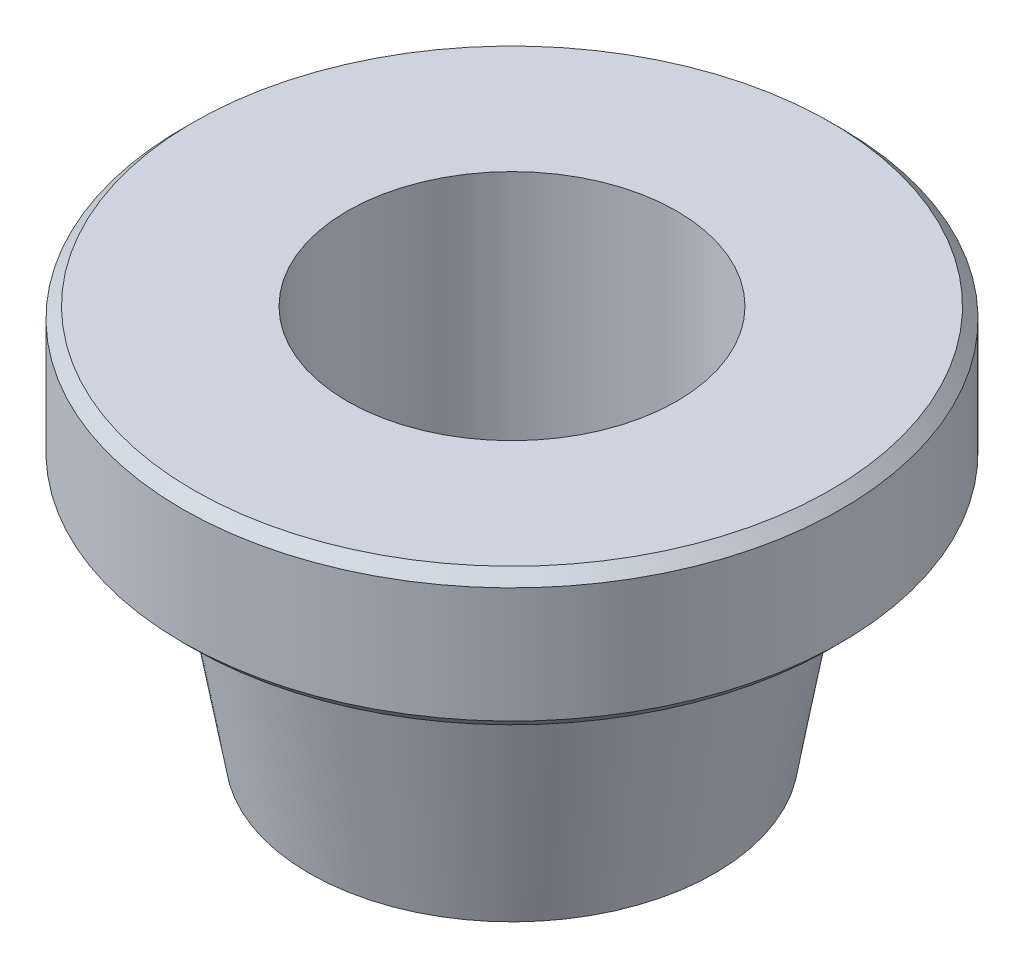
ISO-10303-21;
HEADER;
FILE_DESCRIPTION(('STEP AP214'),'2;1');
FILE_NAME('part.step','',(''),(''),'','','');
FILE_SCHEMA(('AUTOMOTIVE_DESIGN { 1 0 10303 214 1 1 1 1 }'));
ENDSEC;
DATA;
#1=APPLICATION_CONTEXT('core data for automotive mechanical design processes');
#2=APPLICATION_PROTOCOL_DEFINITION('international standard','automotive_design',2000,#1);
#3=PRODUCT_CONTEXT('',#1,'mechanical');
#4=PRODUCT('Part','Part','',(#3));
#5=PRODUCT_RELATED_PRODUCT_CATEGORY('part','',(#4));
#6=PRODUCT_DEFINITION_FORMATION('','',#4);
#7=PRODUCT_DEFINITION_CONTEXT('part definition',#1,'design');
#8=PRODUCT_DEFINITION('design','',#6,#7);
#9=PRODUCT_DEFINITION_SHAPE('','',#8);
#10=(LENGTH_UNIT() NAMED_UNIT(*) SI_UNIT(.MILLI.,.METRE.));
#11=(NAMED_UNIT(*) PLANE_ANGLE_UNIT() SI_UNIT($,.RADIAN.));
#12=(NAMED_UNIT(*) SI_UNIT($,.STERADIAN.) SOLID_ANGLE_UNIT());
#13=UNCERTAINTY_MEASURE_WITH_UNIT(LENGTH_MEASURE(1.E-05),#10,'distance_accuracy_value','');
#14=(GEOMETRIC_REPRESENTATION_CONTEXT(3) GLOBAL_UNCERTAINTY_ASSIGNED_CONTEXT((#13)) GLOBAL_UNIT_ASSIGNED_CONTEXT((#10,
#11,#12)) REPRESENTATION_CONTEXT('',''));
#15=CARTESIAN_POINT('',(0.,0.,0.));
#16=DIRECTION('',(0.,0.,1.));
#17=DIRECTION('',(1.,0.,0.));
#18=AXIS2_PLACEMENT_3D('',#15,#16,#17);
#19=CARTESIAN_POINT('',(0.,0.,0.));
#20=DIRECTION('',(0.,1.,0.));
#21=DIRECTION('',(0.,0.,1.));
#22=AXIS2_PLACEMENT_3D('',#19,#20,#21);
#23=CYLINDRICAL_SURFACE('',#22,3.);
#24=CARTESIAN_POINT('',(0.,-3.1,0.));
#25=DIRECTION('',(0.,1.,0.));
#26=DIRECTION('',(0.,0.,1.));
#27=AXIS2_PLACEMENT_3D('',#24,#25,#26);
#28=CIRCLE('',#27,3.);
#29=CARTESIAN_POINT('',(0.,-3.1,3.));
#30=VERTEX_POINT('',#29);
#31=EDGE_CURVE('E66',#30,#30,#28,.T.);
#32=ORIENTED_EDGE('',*,*,#31,.F.);
#33=EDGE_LOOP('',(#32));
#34=FACE_BOUND('',#33,.T.);
#35=CARTESIAN_POINT('',(0.,2.5,0.));
#36=DIRECTION('',(0.,1.,0.));
#37=DIRECTION('',(0.,0.,1.));
#38=AXIS2_PLACEMENT_3D('',#35,#36,#37);
#39=CIRCLE('',#38,3.);
#40=CARTESIAN_POINT('',(0.,2.5,3.));
#41=VERTEX_POINT('',#40);
#42=EDGE_CURVE('E57',#41,#41,#39,.T.);
#43=ORIENTED_EDGE('',*,*,#42,.T.);
#44=EDGE_LOOP('',(#43));
#45=FACE_BOUND('',#44,.T.);
#46=ADVANCED_FACE('F31',(#34,#45),#23,.F.);
#47=CARTESIAN_POINT('',(0.,0.,0.));
#48=DIRECTION('',(0.,1.,0.));
#49=DIRECTION('',(0.,0.,1.));
#50=AXIS2_PLACEMENT_3D('',#47,#48,#49);
#51=CONICAL_SURFACE('',#50,4.5,0.174532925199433);
#52=CARTESIAN_POINT('',(0.,-4.6,0.));
#53=DIRECTION('',(0.,1.,0.));
#54=DIRECTION('',(0.,0.,1.));
#55=AXIS2_PLACEMENT_3D('',#52,#53,#54);
#56=CIRCLE('',#55,3.68889588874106);
#57=CARTESIAN_POINT('',(0.,-4.6,3.68889588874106));
#58=VERTEX_POINT('',#57);
#59=EDGE_CURVE('E51',#58,#58,#56,.T.);
#60=ORIENTED_EDGE('',*,*,#59,.T.);
#61=EDGE_LOOP('',(#60));
#62=FACE_BOUND('',#61,.T.);
#63=CARTESIAN_POINT('',(0.,0.,0.));
#64=DIRECTION('',(0.,1.,0.));
#65=DIRECTION('',(0.,0.,1.));
#66=AXIS2_PLACEMENT_3D('',#63,#64,#65);
#67=CIRCLE('',#66,4.5);
#68=CARTESIAN_POINT('',(0.,0.,4.5));
#69=VERTEX_POINT('',#68);
#70=EDGE_CURVE('E54',#69,#69,#67,.T.);
#71=ORIENTED_EDGE('',*,*,#70,.F.);
#72=EDGE_LOOP('',(#71));
#73=FACE_BOUND('',#72,.T.);
#74=ADVANCED_FACE('F93',(#62,#73),#51,.T.);
#75=CARTESIAN_POINT('',(0.,-4.6,0.));
#76=DIRECTION('',(0.,1.,0.));
#77=DIRECTION('',(0.,0.,1.));
#78=AXIS2_PLACEMENT_3D('',#75,#76,#77);
#79=PLANE('',#78);
#80=CARTESIAN_POINT('',(0.,-4.6,0.));
#81=DIRECTION('',(0.,-1.,0.));
#82=DIRECTION('',(0.,0.,-1.));
#83=AXIS2_PLACEMENT_3D('',#80,#81,#82);
#84=CIRCLE('',#83,3.);
#85=CARTESIAN_POINT('',(0.,-4.6,-3.));
#86=VERTEX_POINT('',#85);
#87=EDGE_CURVE('E60',#86,#86,#84,.T.);
#88=ORIENTED_EDGE('',*,*,#87,.F.);
#89=EDGE_LOOP('',(#88));
#90=FACE_BOUND('',#89,.T.);
#91=ORIENTED_EDGE('',*,*,#59,.F.);
#92=EDGE_LOOP('',(#91));
#93=FACE_BOUND('',#92,.T.);
#94=ADVANCED_FACE('F108',(#90,#93),#79,.F.);
#95=CARTESIAN_POINT('',(0.,2.5,0.));
#96=DIRECTION('',(0.,-1.,0.));
#97=DIRECTION('',(0.,0.,-1.));
#98=AXIS2_PLACEMENT_3D('',#95,#96,#97);
#99=CYLINDRICAL_SURFACE('',#98,6.);
#100=CARTESIAN_POINT('',(0.,0.199999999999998,0.));
#101=DIRECTION('',(0.,1.,0.));
#102=DIRECTION('',(0.,0.,1.));
#103=AXIS2_PLACEMENT_3D('',#100,#101,#102);
#104=CIRCLE('',#103,6.);
#105=CARTESIAN_POINT('',(0.,0.199999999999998,6.));
#106=VERTEX_POINT('',#105);
#107=EDGE_CURVE('E42',#106,#106,#104,.T.);
#108=ORIENTED_EDGE('',*,*,#107,.T.);
#109=EDGE_LOOP('',(#108));
#110=FACE_BOUND('',#109,.T.);
#111=CARTESIAN_POINT('',(0.,2.3,0.));
#112=DIRECTION('',(0.,1.,0.));
#113=DIRECTION('',(0.,0.,1.));
#114=AXIS2_PLACEMENT_3D('',#111,#112,#113);
#115=CIRCLE('',#114,6.);
#116=CARTESIAN_POINT('',(0.,2.3,6.));
#117=VERTEX_POINT('',#116);
#118=EDGE_CURVE('E46',#117,#117,#115,.F.);
#119=ORIENTED_EDGE('',*,*,#118,.T.);
#120=EDGE_LOOP('',(#119));
#121=FACE_BOUND('',#120,.T.);
#122=ADVANCED_FACE('F100',(#110,#121),#99,.T.);
#123=CARTESIAN_POINT('',(0.,2.5,0.));
#124=DIRECTION('',(0.,1.,0.));
#125=DIRECTION('',(0.,0.,1.));
#126=AXIS2_PLACEMENT_3D('',#123,#124,#125);
#127=PLANE('',#126);
#128=ORIENTED_EDGE('',*,*,#42,.F.);
#129=EDGE_LOOP('',(#128));
#130=FACE_BOUND('',#129,.T.);
#131=CARTESIAN_POINT('',(0.,2.5,0.));
#132=DIRECTION('',(0.,1.,0.));
#133=DIRECTION('',(0.,0.,1.));
#134=AXIS2_PLACEMENT_3D('',#131,#132,#133);
#135=CIRCLE('',#134,5.8);
#136=CARTESIAN_POINT('',(0.,2.5,5.8));
#137=VERTEX_POINT('',#136);
#138=EDGE_CURVE('E10',#137,#137,#135,.T.);
#139=ORIENTED_EDGE('',*,*,#138,.T.);
#140=EDGE_LOOP('',(#139));
#141=FACE_BOUND('',#140,.T.);
#142=ADVANCED_FACE('F97',(#130,#141),#127,.T.);
#143=CARTESIAN_POINT('',(0.,0.,0.));
#144=DIRECTION('',(0.,1.,0.));
#145=DIRECTION('',(0.,0.,1.));
#146=AXIS2_PLACEMENT_3D('',#143,#144,#145);
#147=PLANE('',#146);
#148=CARTESIAN_POINT('',(0.,0.,0.));
#149=DIRECTION('',(0.,1.,0.));
#150=DIRECTION('',(0.,0.,1.));
#151=AXIS2_PLACEMENT_3D('',#148,#149,#150);
#152=CIRCLE('',#151,5.8);
#153=CARTESIAN_POINT('',(0.,0.,5.8));
#154=VERTEX_POINT('',#153);
#155=EDGE_CURVE('E38',#154,#154,#152,.F.);
#156=ORIENTED_EDGE('',*,*,#155,.T.);
#157=EDGE_LOOP('',(#156));
#158=FACE_BOUND('',#157,.T.);
#159=ORIENTED_EDGE('',*,*,#70,.T.);
#160=EDGE_LOOP('',(#159));
#161=FACE_BOUND('',#160,.T.);
#162=ADVANCED_FACE('F99',(#158,#161),#147,.F.);
#163=CARTESIAN_POINT('',(0.,0.199999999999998,0.));
#164=DIRECTION('',(0.,1.,0.));
#165=DIRECTION('',(0.,0.,1.));
#166=AXIS2_PLACEMENT_3D('',#163,#164,#165);
#167=CONICAL_SURFACE('',#166,6.,0.785398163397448);
#168=ORIENTED_EDGE('',*,*,#155,.F.);
#169=EDGE_LOOP('',(#168));
#170=FACE_BOUND('',#169,.T.);
#171=ORIENTED_EDGE('',*,*,#107,.F.);
#172=EDGE_LOOP('',(#171));
#173=FACE_BOUND('',#172,.T.);
#174=ADVANCED_FACE('F106',(#170,#173),#167,.T.);
#175=CARTESIAN_POINT('',(0.,2.5,0.));
#176=DIRECTION('',(0.,-1.,0.));
#177=DIRECTION('',(0.,0.,-1.));
#178=AXIS2_PLACEMENT_3D('',#175,#176,#177);
#179=CONICAL_SURFACE('',#178,5.8,0.785398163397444);
#180=ORIENTED_EDGE('',*,*,#118,.F.);
#181=EDGE_LOOP('',(#180));
#182=FACE_BOUND('',#181,.T.);
#183=ORIENTED_EDGE('',*,*,#138,.F.);
#184=EDGE_LOOP('',(#183));
#185=FACE_BOUND('',#184,.T.);
#186=ADVANCED_FACE('F33',(#182,#185),#179,.T.);
#187=CARTESIAN_POINT('',(0.,-3.6,0.));
#188=DIRECTION('',(0.,1.,0.));
#189=DIRECTION('',(0.,0.,1.));
#190=AXIS2_PLACEMENT_3D('',#187,#188,#189);
#191=CIRCLE('',#190,3.);
#192=CARTESIAN_POINT('',(0.,-3.6,3.));
#193=VERTEX_POINT('',#192);
#194=EDGE_CURVE('E69',#193,#193,#191,.T.);
#195=ORIENTED_EDGE('',*,*,#194,.T.);
#196=EDGE_LOOP('',(#195));
#197=FACE_BOUND('',#196,.T.);
#198=ORIENTED_EDGE('',*,*,#87,.T.);
#199=EDGE_LOOP('',(#198));
#200=FACE_BOUND('',#199,.T.);
#201=ADVANCED_FACE('F82',(#197,#200),#23,.F.);
#202=CARTESIAN_POINT('',(0.,2.5,0.));
#203=DIRECTION('',(0.,1.,0.));
#204=DIRECTION('',(0.,0.,1.));
#205=AXIS2_PLACEMENT_3D('',#202,#203,#204);
#206=CYLINDRICAL_SURFACE('',#205,3.3);
#207=CARTESIAN_POINT('',(0.,-3.6,0.));
#208=DIRECTION('',(0.,1.,0.));
#209=DIRECTION('',(0.,0.,1.));
#210=AXIS2_PLACEMENT_3D('',#207,#208,#209);
#211=CIRCLE('',#210,3.3);
#212=CARTESIAN_POINT('',(0.,-3.6,3.3));
#213=VERTEX_POINT('',#212);
#214=EDGE_CURVE('E72',#213,#213,#211,.T.);
#215=ORIENTED_EDGE('',*,*,#214,.F.);
#216=EDGE_LOOP('',(#215));
#217=FACE_BOUND('',#216,.T.);
#218=CARTESIAN_POINT('',(0.,-3.1,0.));
#219=DIRECTION('',(0.,1.,0.));
#220=DIRECTION('',(0.,0.,1.));
#221=AXIS2_PLACEMENT_3D('',#218,#219,#220);
#222=CIRCLE('',#221,3.3);
#223=CARTESIAN_POINT('',(0.,-3.1,3.3));
#224=VERTEX_POINT('',#223);
#225=EDGE_CURVE('E63',#224,#224,#222,.T.);
#226=ORIENTED_EDGE('',*,*,#225,.T.);
#227=EDGE_LOOP('',(#226));
#228=FACE_BOUND('',#227,.T.);
#229=ADVANCED_FACE('F78',(#217,#228),#206,.F.);
#230=CARTESIAN_POINT('',(-3.3,-3.1,0.));
#231=DIRECTION('',(0.,1.,0.));
#232=DIRECTION('',(0.,0.,1.));
#233=AXIS2_PLACEMENT_3D('',#230,#231,#232);
#234=PLANE('',#233);
#235=ORIENTED_EDGE('',*,*,#225,.F.);
#236=EDGE_LOOP('',(#235));
#237=FACE_BOUND('',#236,.T.);
#238=ORIENTED_EDGE('',*,*,#31,.T.);
#239=EDGE_LOOP('',(#238));
#240=FACE_BOUND('',#239,.T.);
#241=ADVANCED_FACE('F81',(#237,#240),#234,.F.);
#242=CARTESIAN_POINT('',(-3.3,-3.6,0.));
#243=DIRECTION('',(0.,-1.,0.));
#244=DIRECTION('',(0.,0.,-1.));
#245=AXIS2_PLACEMENT_3D('',#242,#243,#244);
#246=PLANE('',#245);
#247=ORIENTED_EDGE('',*,*,#194,.F.);
#248=EDGE_LOOP('',(#247));
#249=FACE_BOUND('',#248,.T.);
#250=ORIENTED_EDGE('',*,*,#214,.T.);
#251=EDGE_LOOP('',(#250));
#252=FACE_BOUND('',#251,.T.);
#253=ADVANCED_FACE('F76',(#249,#252),#246,.F.);
#254=CLOSED_SHELL('',(#46,#74,#94,#122,#142,#162,#174,#186,#201,#229,#241,#253));
#255=MANIFOLD_SOLID_BREP('B2',#254);
#256=ADVANCED_BREP_SHAPE_REPRESENTATION('',(#18,#255),#14);
#257=SHAPE_DEFINITION_REPRESENTATION(#9,#256);
ENDSEC;
END-ISO-10303-21;
